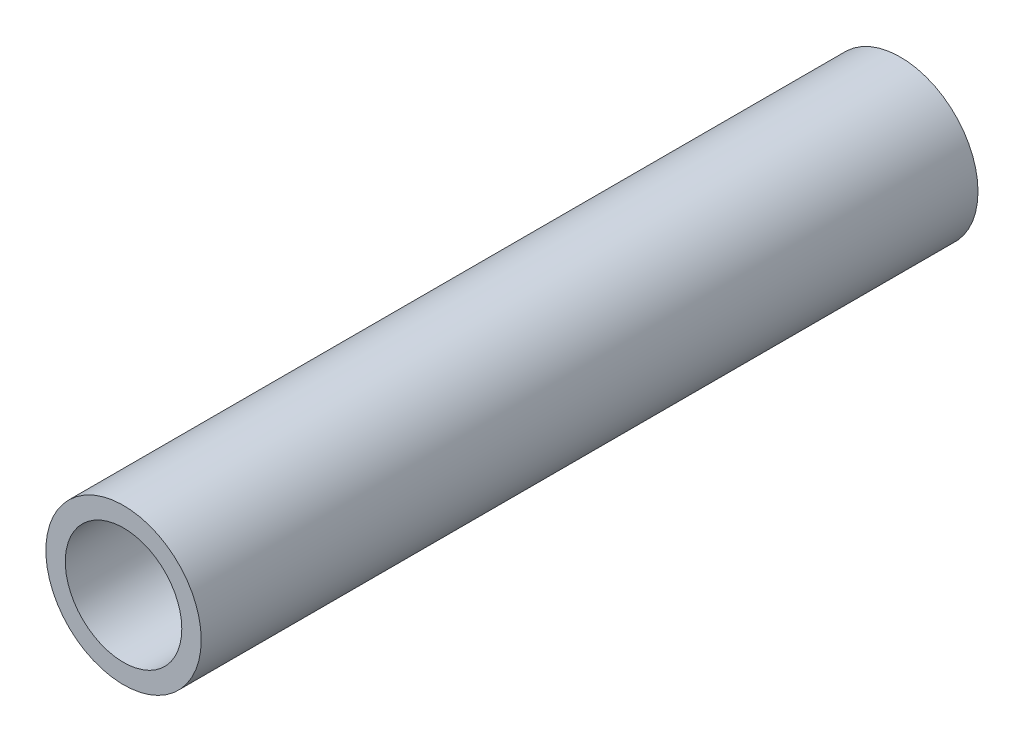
from build123d import *

# Parameters (mm, degrees)
ESQUISSE1_R                       = 2
BOSS_EXTRU_1_DEPTH                = 20
DIAM_TRE_DU_PER_AGE_0_15_0_15_1_D = 3


with BuildPart() as part:
    # Esquisse1 → Boss.-Extru.1 (new body)
    with BuildSketch(Plane.XY):
        Circle(ESQUISSE1_R)
    extrude(amount=BOSS_EXTRU_1_DEPTH)

    # Diam_tre du per_age _0.15 _0.15_1 (through all)
    with Locations(Plane.XY.offset(20)):
        with Locations((0, 0)):
            Hole(DIAM_TRE_DU_PER_AGE_0_15_0_15_1_D / 2)


solid = part.part
